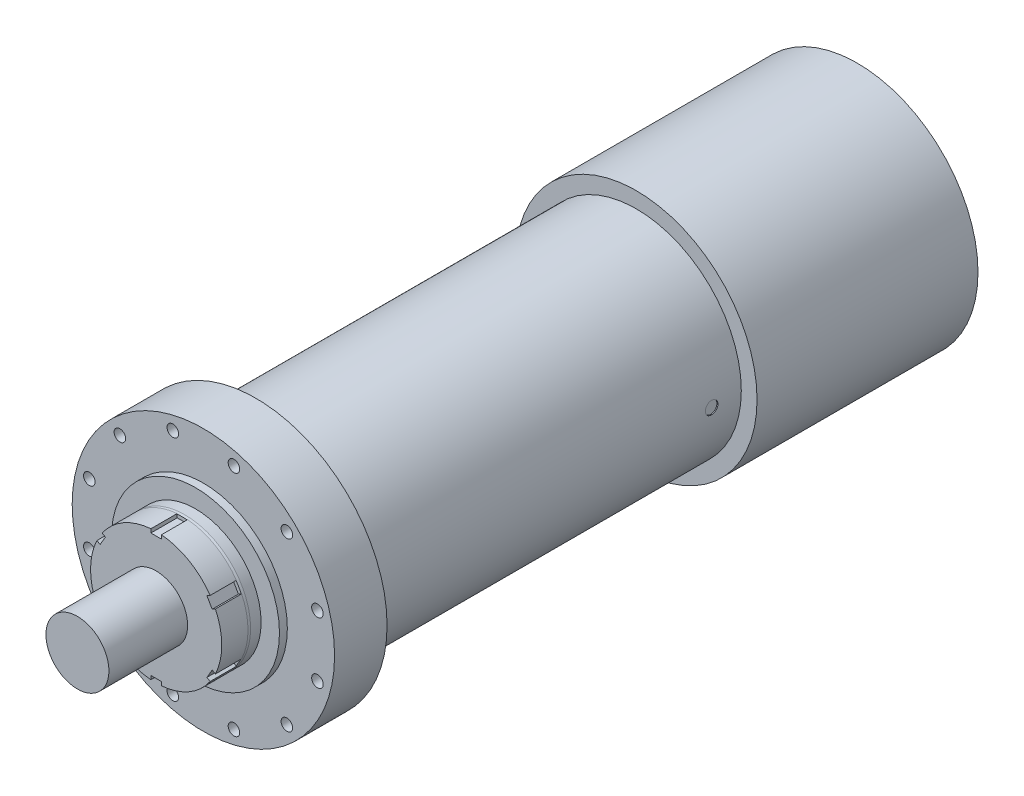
from build123d import *

# Parameters (mm, degrees)
SKETCH_1_R          = 200
EXTRUDE_1_DEPTH     = 725
SKETCH_2_R          = 250
SKETCH_2_R_2        = 11
EXTRUDE_2_DEPTH     = 100
SKETCH_3_R          = 160
EXTRUDE_3_DEPTH     = 15
SKETCH_4_R          = 125
EXTRUDE_4_DEPTH     = 25
CHAMFER_1_SIZE      = 5
CHAMFER_1_SIZE2     = 0.881634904
SKETCH_6_R          = 230
EXTRUDE_6_DEPTH     = 421
SKETCH_9_R          = 12
CUT_EXTRUDE_2_DEPTH = 2
SKETCH_10_R         = 12
CUT_EXTRUDE_3_DEPTH = 2
EXTRUDE_7_DEPTH     = 50
SKETCH_11_R         = 60
EXTRUDE_8_DEPTH     = 150


with BuildPart() as part:
    # Sketch 1 → Extrude 1 (new body)
    with BuildSketch(Plane.XY):
        Circle(SKETCH_1_R)
    extrude(amount=EXTRUDE_1_DEPTH)

    # Sketch 2 → Extrude 2 (add)
    with BuildSketch(Plane.XY.offset(725)):
        Circle(SKETCH_2_R)
        with Locations((217.333310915, 58.234285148)):
            Circle(SKETCH_2_R_2, mode=Mode.SUBTRACT)
        with Locations((217.333310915, -58.234285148)):
            Circle(SKETCH_2_R_2, mode=Mode.SUBTRACT)
        with Locations((159.099025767, -159.099025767)):
            Circle(SKETCH_2_R_2, mode=Mode.SUBTRACT)
        with Locations((58.234285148, -217.333310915)):
            Circle(SKETCH_2_R_2, mode=Mode.SUBTRACT)
        with Locations((-58.234285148, -217.333310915)):
            Circle(SKETCH_2_R_2, mode=Mode.SUBTRACT)
        with Locations((-159.099025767, -159.099025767)):
            Circle(SKETCH_2_R_2, mode=Mode.SUBTRACT)
        with Locations((-217.333310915, -58.234285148)):
            Circle(SKETCH_2_R_2, mode=Mode.SUBTRACT)
        with Locations((-217.333310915, 58.234285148)):
            Circle(SKETCH_2_R_2, mode=Mode.SUBTRACT)
        with Locations((-159.099025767, 159.099025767)):
            Circle(SKETCH_2_R_2, mode=Mode.SUBTRACT)
        with Locations((-58.234285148, 217.333310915)):
            Circle(SKETCH_2_R_2, mode=Mode.SUBTRACT)
        with Locations((58.234285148, 217.333310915)):
            Circle(SKETCH_2_R_2, mode=Mode.SUBTRACT)
        with Locations((159.099025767, 159.099025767)):
            Circle(SKETCH_2_R_2, mode=Mode.SUBTRACT)
    extrude(amount=EXTRUDE_2_DEPTH)

    # Sketch 3 → Extrude 3 (add)
    with BuildSketch(Plane.XY.offset(825)):
        Circle(SKETCH_3_R)
    extrude(amount=EXTRUDE_3_DEPTH)

    # Sketch 4 → Extrude 4 (add)
    with BuildSketch(Plane.XY.offset(840)):
        Circle(SKETCH_4_R)
    extrude(amount=EXTRUDE_4_DEPTH)

    # Chamfer 1
    chamfer_1_edges = [part.edges().sort_by_distance(p)[0] for p in [
        (-125, 0, 865),
    ]]
    chamfer_1_side = [part.faces().sort_by_distance(p)[0] for p in [
        (-125, 0, 852.5),
    ]]
    chamfer(chamfer_1_edges, length=CHAMFER_1_SIZE, length2=CHAMFER_1_SIZE2, reference=chamfer_1_side[0])

    # Sketch 6 → Extrude 6 (add)
    with BuildSketch(Plane(origin=(0, 0, 0), x_dir=(-1, 0, 0), z_dir=(0, 0, -1))):
        with Locations(Location((0, 0, 0), (0, 0, 180))):
            Circle(SKETCH_6_R)
    extrude(amount=EXTRUDE_6_DEPTH)

    # Sketch 9 → Cut-Extrude 2 (cut)
    with BuildSketch(Plane(origin=(-200, 0, 0), x_dir=(0, 0, -1), z_dir=(1, 0, 0))):
        with Locations(Location((-36.5, 0, 0), (0, 0, 180))):
            Circle(SKETCH_9_R)
        with Locations(Location((-670.5, 0, 0), (0, 0, 180))):
            Circle(SKETCH_9_R)
    extrude(amount=CUT_EXTRUDE_2_DEPTH, mode=Mode.SUBTRACT)

    # Sketch 10 → Cut-Extrude 3 (cut)
    with BuildSketch(Plane(origin=(200, 0, 0), x_dir=(0, 0, -1), z_dir=(1, 0, 0))):
        with Locations((-56.5, 0)):
            Circle(SKETCH_10_R)
    extrude(amount=-CUT_EXTRUDE_3_DEPTH, mode=Mode.SUBTRACT)

    # Sketch 5 → Extrude 7 (add)
    with BuildSketch(Plane.XY.offset(865)):
        with BuildLine():
            Line((-10, 124.599357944), (-10, 117.5))
            Line((-10, 117.5), (10, 117.5))
            Line((10, 117.5), (10, 124.599357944))
            ThreePointArc((10, 124.599357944), (62.5, 108.253175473), (102.906209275, 70.95993301))
            Line((102.906209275, 70.95993301), (96.757984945, 67.410254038))
            Line((96.757984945, 67.410254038), (106.757984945, 50.089745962))
            Line((106.757984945, 50.089745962), (112.906209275, 53.639424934))
            ThreePointArc((112.906209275, 53.639424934), (125, 0), (112.906209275, -53.639424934))
            Line((112.906209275, -53.639424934), (106.757984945, -50.089745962))
            Line((106.757984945, -50.089745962), (96.757984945, -67.410254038))
            Line((96.757984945, -67.410254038), (102.906209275, -70.95993301))
            ThreePointArc((102.906209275, -70.95993301), (62.5, -108.253175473), (10, -124.599357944))
            Line((10, -124.599357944), (10, -117.5))
            Line((10, -117.5), (-10, -117.5))
            Line((-10, -117.5), (-10, -124.599357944))
            ThreePointArc((-10, -124.599357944), (-62.5, -108.253175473), (-102.906209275, -70.95993301))
            Line((-102.906209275, -70.95993301), (-96.757984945, -67.410254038))
            Line((-96.757984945, -67.410254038), (-106.757984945, -50.089745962))
            Line((-106.757984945, -50.089745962), (-112.906209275, -53.639424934))
            ThreePointArc((-112.906209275, -53.639424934), (-125, 0), (-112.906209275, 53.639424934))
            Line((-112.906209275, 53.639424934), (-106.757984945, 50.089745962))
            Line((-106.757984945, 50.089745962), (-96.757984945, 67.410254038))
            Line((-96.757984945, 67.410254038), (-102.906209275, 70.95993301))
            ThreePointArc((-102.906209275, 70.95993301), (-62.5, 108.253175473), (-10, 124.599357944))
        make_face()
    extrude(amount=EXTRUDE_7_DEPTH)

    # Sketch 11 → Extrude 8 (add)
    with BuildSketch(Plane.XY.offset(915)):
        Circle(SKETCH_11_R)
    extrude(amount=EXTRUDE_8_DEPTH)


solid = part.part
